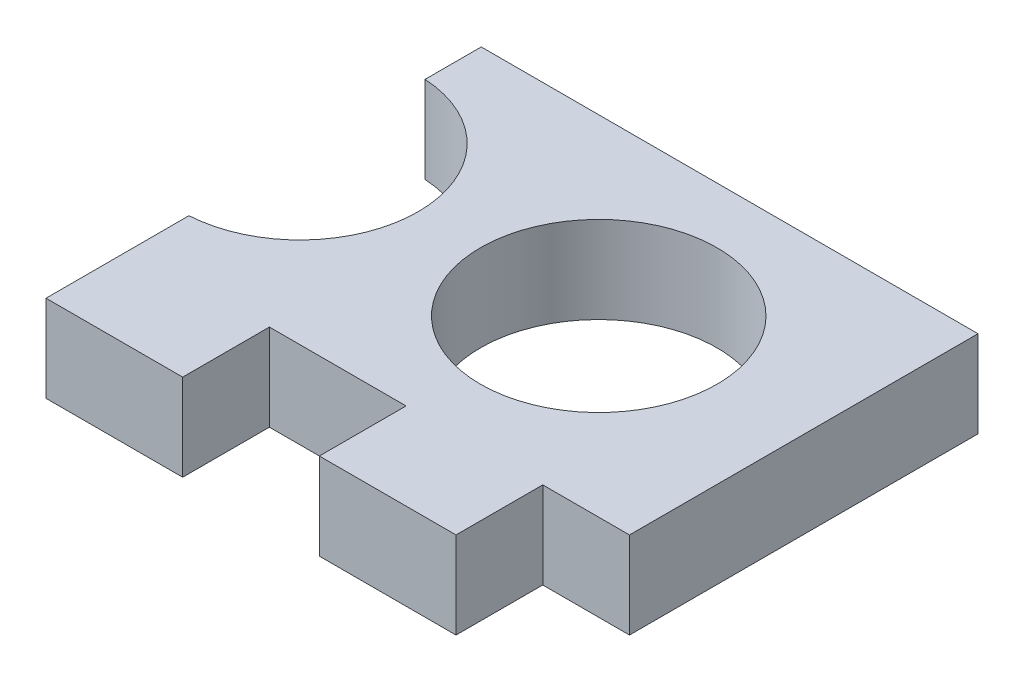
ISO-10303-21;
HEADER;
FILE_DESCRIPTION(('STEP AP214'),'2;1');
FILE_NAME('part.step','',(''),(''),'','','');
FILE_SCHEMA(('AUTOMOTIVE_DESIGN { 1 0 10303 214 1 1 1 1 }'));
ENDSEC;
DATA;
#1=APPLICATION_CONTEXT('core data for automotive mechanical design processes');
#2=APPLICATION_PROTOCOL_DEFINITION('international standard','automotive_design',2000,#1);
#3=PRODUCT_CONTEXT('',#1,'mechanical');
#4=PRODUCT('Part','Part','',(#3));
#5=PRODUCT_RELATED_PRODUCT_CATEGORY('part','',(#4));
#6=PRODUCT_DEFINITION_FORMATION('','',#4);
#7=PRODUCT_DEFINITION_CONTEXT('part definition',#1,'design');
#8=PRODUCT_DEFINITION('design','',#6,#7);
#9=PRODUCT_DEFINITION_SHAPE('','',#8);
#10=(LENGTH_UNIT() NAMED_UNIT(*) SI_UNIT(.MILLI.,.METRE.));
#11=(NAMED_UNIT(*) PLANE_ANGLE_UNIT() SI_UNIT($,.RADIAN.));
#12=(NAMED_UNIT(*) SI_UNIT($,.STERADIAN.) SOLID_ANGLE_UNIT());
#13=UNCERTAINTY_MEASURE_WITH_UNIT(LENGTH_MEASURE(1.E-05),#10,'distance_accuracy_value','');
#14=(GEOMETRIC_REPRESENTATION_CONTEXT(3) GLOBAL_UNCERTAINTY_ASSIGNED_CONTEXT((#13)) GLOBAL_UNIT_ASSIGNED_CONTEXT((#10,
#11,#12)) REPRESENTATION_CONTEXT('',''));
#15=CARTESIAN_POINT('',(0.,0.,0.));
#16=DIRECTION('',(0.,0.,1.));
#17=DIRECTION('',(1.,0.,0.));
#18=AXIS2_PLACEMENT_3D('',#15,#16,#17);
#19=CARTESIAN_POINT('',(-10.0398078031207,5.5,-2.49490250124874));
#20=DIRECTION('',(0.,1.,0.));
#21=DIRECTION('',(0.,0.,1.));
#22=AXIS2_PLACEMENT_3D('',#19,#20,#21);
#23=PLANE('',#22);
#24=DIRECTION('',(0.,0.,1.));
#25=VECTOR('',#24,1.);
#26=CARTESIAN_POINT('',(-9.5898078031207,5.5,8.55509749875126));
#27=LINE('',#26,#25);
#28=CARTESIAN_POINT('',(-9.5898078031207,5.5,4.99158532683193));
#29=VERTEX_POINT('',#28);
#30=CARTESIAN_POINT('',(-9.5898078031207,5.5,14.0550974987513));
#31=VERTEX_POINT('',#30);
#32=EDGE_CURVE('E108',#29,#31,#27,.T.);
#33=ORIENTED_EDGE('',*,*,#32,.T.);
#34=DIRECTION('',(1.,0.,0.));
#35=VECTOR('',#34,1.);
#36=CARTESIAN_POINT('',(-9.5898078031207,5.5,14.0550974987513));
#37=LINE('',#36,#35);
#38=CARTESIAN_POINT('',(-0.923140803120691,5.5,14.0550974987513));
#39=VERTEX_POINT('',#38);
#40=EDGE_CURVE('E249',#31,#39,#37,.T.);
#41=ORIENTED_EDGE('',*,*,#40,.T.);
#42=DIRECTION('',(0.,0.,-1.));
#43=VECTOR('',#42,1.);
#44=CARTESIAN_POINT('',(-0.923140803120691,5.5,14.0550974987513));
#45=LINE('',#44,#43);
#46=CARTESIAN_POINT('',(-0.923140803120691,5.5,8.55509749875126));
#47=VERTEX_POINT('',#46);
#48=EDGE_CURVE('E208',#39,#47,#45,.T.);
#49=ORIENTED_EDGE('',*,*,#48,.T.);
#50=DIRECTION('',(1.,0.,0.));
#51=VECTOR('',#50,1.);
#52=CARTESIAN_POINT('',(-0.923140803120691,5.5,8.55509749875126));
#53=LINE('',#52,#51);
#54=CARTESIAN_POINT('',(7.7435251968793,5.5,8.55509749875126));
#55=VERTEX_POINT('',#54);
#56=EDGE_CURVE('E227',#47,#55,#53,.T.);
#57=ORIENTED_EDGE('',*,*,#56,.T.);
#58=DIRECTION('',(0.,0.,1.));
#59=VECTOR('',#58,1.);
#60=CARTESIAN_POINT('',(7.7435251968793,5.5,8.55509749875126));
#61=LINE('',#60,#59);
#62=CARTESIAN_POINT('',(7.7435251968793,5.5,14.0550974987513));
#63=VERTEX_POINT('',#62);
#64=EDGE_CURVE('E224',#55,#63,#61,.T.);
#65=ORIENTED_EDGE('',*,*,#64,.T.);
#66=DIRECTION('',(1.,0.,0.));
#67=VECTOR('',#66,1.);
#68=CARTESIAN_POINT('',(7.7435251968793,5.5,14.0550974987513));
#69=LINE('',#68,#67);
#70=CARTESIAN_POINT('',(16.4101921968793,5.5,14.0550974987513));
#71=VERTEX_POINT('',#70);
#72=EDGE_CURVE('E226',#63,#71,#69,.T.);
#73=ORIENTED_EDGE('',*,*,#72,.T.);
#74=DIRECTION('',(0.,0.,-1.));
#75=VECTOR('',#74,1.);
#76=CARTESIAN_POINT('',(16.4101921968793,5.5,14.0550974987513));
#77=LINE('',#76,#75);
#78=CARTESIAN_POINT('',(16.4101921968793,5.5,8.55509749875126));
#79=VERTEX_POINT('',#78);
#80=EDGE_CURVE('E229',#71,#79,#77,.T.);
#81=ORIENTED_EDGE('',*,*,#80,.T.);
#82=DIRECTION('',(1.,0.,0.));
#83=VECTOR('',#82,1.);
#84=CARTESIAN_POINT('',(16.4101921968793,5.5,8.55509749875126));
#85=LINE('',#84,#83);
#86=CARTESIAN_POINT('',(21.9101921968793,5.5,8.55509749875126));
#87=VERTEX_POINT('',#86);
#88=EDGE_CURVE('E235',#79,#87,#85,.T.);
#89=ORIENTED_EDGE('',*,*,#88,.T.);
#90=DIRECTION('',(0.,0.,-1.));
#91=VECTOR('',#90,1.);
#92=CARTESIAN_POINT('',(21.9101921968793,5.5,8.55509749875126));
#93=LINE('',#92,#91);
#94=CARTESIAN_POINT('',(21.9101921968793,5.5,-13.5449025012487));
#95=VERTEX_POINT('',#94);
#96=EDGE_CURVE('E140',#87,#95,#93,.T.);
#97=ORIENTED_EDGE('',*,*,#96,.T.);
#98=DIRECTION('',(-1.,0.,0.));
#99=VECTOR('',#98,1.);
#100=CARTESIAN_POINT('',(21.9101921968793,5.5,-13.5449025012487));
#101=LINE('',#100,#99);
#102=CARTESIAN_POINT('',(-9.5898078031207,5.5,-13.5449025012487));
#103=VERTEX_POINT('',#102);
#104=EDGE_CURVE('E134',#95,#103,#101,.T.);
#105=ORIENTED_EDGE('',*,*,#104,.T.);
#106=DIRECTION('',(0.,0.,1.));
#107=VECTOR('',#106,1.);
#108=CARTESIAN_POINT('',(-9.5898078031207,5.5,-13.5449025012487));
#109=LINE('',#108,#107);
#110=CARTESIAN_POINT('',(-9.5898078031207,5.5,-9.98139032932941));
#111=VERTEX_POINT('',#110);
#112=EDGE_CURVE('E138',#103,#111,#109,.T.);
#113=ORIENTED_EDGE('',*,*,#112,.T.);
#114=CARTESIAN_POINT('',(-10.0398078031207,5.5,-2.49490250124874));
#115=DIRECTION('',(0.,-1.,0.));
#116=DIRECTION('',(0.,0.,1.));
#117=AXIS2_PLACEMENT_3D('',#114,#115,#116);
#118=CIRCLE('',#117,7.5);
#119=EDGE_CURVE('E54',#111,#29,#118,.T.);
#120=ORIENTED_EDGE('',*,*,#119,.T.);
#121=EDGE_LOOP('',(#33,#41,#49,#57,#65,#73,#81,#89,#97,#105,#113,#120));
#122=FACE_BOUND('',#121,.T.);
#123=CARTESIAN_POINT('',(8.91019219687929,5.5,-2.49490250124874));
#124=DIRECTION('',(0.,1.,0.));
#125=DIRECTION('',(0.,0.,1.));
#126=AXIS2_PLACEMENT_3D('',#123,#124,#125);
#127=CIRCLE('',#126,7.5);
#128=CARTESIAN_POINT('',(8.91019219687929,5.5,5.00509749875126));
#129=VERTEX_POINT('',#128);
#130=EDGE_CURVE('E160',#129,#129,#127,.T.);
#131=ORIENTED_EDGE('',*,*,#130,.F.);
#132=EDGE_LOOP('',(#131));
#133=FACE_BOUND('',#132,.T.);
#134=ADVANCED_FACE('F37',(#122,#133),#23,.T.);
#135=CARTESIAN_POINT('',(-10.0398078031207,0.,-2.49490250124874));
#136=DIRECTION('',(0.,1.,0.));
#137=DIRECTION('',(0.,0.,1.));
#138=AXIS2_PLACEMENT_3D('',#135,#136,#137);
#139=PLANE('',#138);
#140=DIRECTION('',(0.,0.,1.));
#141=VECTOR('',#140,1.);
#142=CARTESIAN_POINT('',(-9.5898078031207,0.,8.55509749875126));
#143=LINE('',#142,#141);
#144=CARTESIAN_POINT('',(-9.5898078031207,0.,4.99158532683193));
#145=VERTEX_POINT('',#144);
#146=CARTESIAN_POINT('',(-9.5898078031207,0.,14.0550974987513));
#147=VERTEX_POINT('',#146);
#148=EDGE_CURVE('E102',#145,#147,#143,.T.);
#149=ORIENTED_EDGE('',*,*,#148,.F.);
#150=CARTESIAN_POINT('',(-10.0398078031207,0.,-2.49490250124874));
#151=DIRECTION('',(0.,-1.,0.));
#152=DIRECTION('',(0.,0.,1.));
#153=AXIS2_PLACEMENT_3D('',#150,#151,#152);
#154=CIRCLE('',#153,7.5);
#155=CARTESIAN_POINT('',(-9.5898078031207,0.,-9.98139032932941));
#156=VERTEX_POINT('',#155);
#157=EDGE_CURVE('E178',#156,#145,#154,.T.);
#158=ORIENTED_EDGE('',*,*,#157,.F.);
#159=DIRECTION('',(0.,0.,1.));
#160=VECTOR('',#159,1.);
#161=CARTESIAN_POINT('',(-9.5898078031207,0.,-13.5449025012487));
#162=LINE('',#161,#160);
#163=CARTESIAN_POINT('',(-9.5898078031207,0.,-13.5449025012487));
#164=VERTEX_POINT('',#163);
#165=EDGE_CURVE('E95',#164,#156,#162,.T.);
#166=ORIENTED_EDGE('',*,*,#165,.F.);
#167=DIRECTION('',(-1.,0.,0.));
#168=VECTOR('',#167,1.);
#169=CARTESIAN_POINT('',(21.9101921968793,0.,-13.5449025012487));
#170=LINE('',#169,#168);
#171=CARTESIAN_POINT('',(21.9101921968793,0.,-13.5449025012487));
#172=VERTEX_POINT('',#171);
#173=EDGE_CURVE('E148',#172,#164,#170,.T.);
#174=ORIENTED_EDGE('',*,*,#173,.F.);
#175=DIRECTION('',(0.,0.,-1.));
#176=VECTOR('',#175,1.);
#177=CARTESIAN_POINT('',(21.9101921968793,0.,8.55509749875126));
#178=LINE('',#177,#176);
#179=CARTESIAN_POINT('',(21.9101921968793,0.,8.55509749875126));
#180=VERTEX_POINT('',#179);
#181=EDGE_CURVE('E174',#180,#172,#178,.T.);
#182=ORIENTED_EDGE('',*,*,#181,.F.);
#183=DIRECTION('',(1.,0.,0.));
#184=VECTOR('',#183,1.);
#185=CARTESIAN_POINT('',(16.4101921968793,0.,8.55509749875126));
#186=LINE('',#185,#184);
#187=CARTESIAN_POINT('',(16.4101921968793,0.,8.55509749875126));
#188=VERTEX_POINT('',#187);
#189=EDGE_CURVE('E172',#188,#180,#186,.T.);
#190=ORIENTED_EDGE('',*,*,#189,.F.);
#191=DIRECTION('',(0.,0.,-1.));
#192=VECTOR('',#191,1.);
#193=CARTESIAN_POINT('',(16.4101921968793,0.,14.0550974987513));
#194=LINE('',#193,#192);
#195=CARTESIAN_POINT('',(16.4101921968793,0.,14.0550974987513));
#196=VERTEX_POINT('',#195);
#197=EDGE_CURVE('E170',#196,#188,#194,.T.);
#198=ORIENTED_EDGE('',*,*,#197,.F.);
#199=DIRECTION('',(1.,0.,0.));
#200=VECTOR('',#199,1.);
#201=CARTESIAN_POINT('',(7.7435251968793,0.,14.0550974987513));
#202=LINE('',#201,#200);
#203=CARTESIAN_POINT('',(7.7435251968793,0.,14.0550974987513));
#204=VERTEX_POINT('',#203);
#205=EDGE_CURVE('E168',#204,#196,#202,.T.);
#206=ORIENTED_EDGE('',*,*,#205,.F.);
#207=DIRECTION('',(0.,0.,1.));
#208=VECTOR('',#207,1.);
#209=CARTESIAN_POINT('',(7.7435251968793,0.,8.55509749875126));
#210=LINE('',#209,#208);
#211=CARTESIAN_POINT('',(7.7435251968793,0.,8.55509749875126));
#212=VERTEX_POINT('',#211);
#213=EDGE_CURVE('E166',#212,#204,#210,.T.);
#214=ORIENTED_EDGE('',*,*,#213,.F.);
#215=DIRECTION('',(1.,0.,0.));
#216=VECTOR('',#215,1.);
#217=CARTESIAN_POINT('',(-0.923140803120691,0.,8.55509749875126));
#218=LINE('',#217,#216);
#219=CARTESIAN_POINT('',(-0.923140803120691,0.,8.55509749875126));
#220=VERTEX_POINT('',#219);
#221=EDGE_CURVE('E164',#220,#212,#218,.T.);
#222=ORIENTED_EDGE('',*,*,#221,.F.);
#223=DIRECTION('',(0.,0.,-1.));
#224=VECTOR('',#223,1.);
#225=CARTESIAN_POINT('',(-0.923140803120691,0.,14.0550974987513));
#226=LINE('',#225,#224);
#227=CARTESIAN_POINT('',(-0.923140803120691,0.,14.0550974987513));
#228=VERTEX_POINT('',#227);
#229=EDGE_CURVE('E162',#228,#220,#226,.T.);
#230=ORIENTED_EDGE('',*,*,#229,.F.);
#231=DIRECTION('',(1.,0.,0.));
#232=VECTOR('',#231,1.);
#233=CARTESIAN_POINT('',(-9.5898078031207,0.,14.0550974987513));
#234=LINE('',#233,#232);
#235=EDGE_CURVE('E159',#147,#228,#234,.T.);
#236=ORIENTED_EDGE('',*,*,#235,.F.);
#237=EDGE_LOOP('',(#149,#158,#166,#174,#182,#190,#198,#206,#214,#222,#230,#236));
#238=FACE_BOUND('',#237,.T.);
#239=CARTESIAN_POINT('',(8.91019219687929,0.,-2.49490250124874));
#240=DIRECTION('',(0.,1.,0.));
#241=DIRECTION('',(0.,0.,1.));
#242=AXIS2_PLACEMENT_3D('',#239,#240,#241);
#243=CIRCLE('',#242,7.5);
#244=CARTESIAN_POINT('',(8.91019219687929,0.,5.00509749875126));
#245=VERTEX_POINT('',#244);
#246=EDGE_CURVE('E253',#245,#245,#243,.T.);
#247=ORIENTED_EDGE('',*,*,#246,.T.);
#248=EDGE_LOOP('',(#247));
#249=FACE_BOUND('',#248,.T.);
#250=ADVANCED_FACE('F212',(#238,#249),#139,.F.);
#251=CARTESIAN_POINT('',(-9.5898078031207,5.5,8.55509749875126));
#252=DIRECTION('',(1.,0.,0.));
#253=DIRECTION('',(0.,0.,-1.));
#254=AXIS2_PLACEMENT_3D('',#251,#252,#253);
#255=PLANE('',#254);
#256=ORIENTED_EDGE('',*,*,#148,.T.);
#257=DIRECTION('',(0.,-1.,0.));
#258=VECTOR('',#257,1.);
#259=CARTESIAN_POINT('',(-9.5898078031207,5.5,14.0550974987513));
#260=LINE('',#259,#258);
#261=EDGE_CURVE('E11',#31,#147,#260,.T.);
#262=ORIENTED_EDGE('',*,*,#261,.F.);
#263=ORIENTED_EDGE('',*,*,#32,.F.);
#264=DIRECTION('',(0.,-1.,0.));
#265=VECTOR('',#264,1.);
#266=CARTESIAN_POINT('',(-9.5898078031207,5.5,4.99158532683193));
#267=LINE('',#266,#265);
#268=EDGE_CURVE('E154',#29,#145,#267,.T.);
#269=ORIENTED_EDGE('',*,*,#268,.T.);
#270=EDGE_LOOP('',(#256,#262,#263,#269));
#271=FACE_BOUND('',#270,.T.);
#272=ADVANCED_FACE('F39',(#271),#255,.F.);
#273=CARTESIAN_POINT('',(-9.5898078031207,5.5,14.0550974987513));
#274=DIRECTION('',(0.,0.,-1.));
#275=DIRECTION('',(-1.,0.,0.));
#276=AXIS2_PLACEMENT_3D('',#273,#274,#275);
#277=PLANE('',#276);
#278=ORIENTED_EDGE('',*,*,#235,.T.);
#279=DIRECTION('',(0.,-1.,0.));
#280=VECTOR('',#279,1.);
#281=CARTESIAN_POINT('',(-0.923140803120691,5.5,14.0550974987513));
#282=LINE('',#281,#280);
#283=EDGE_CURVE('E46',#39,#228,#282,.T.);
#284=ORIENTED_EDGE('',*,*,#283,.F.);
#285=ORIENTED_EDGE('',*,*,#40,.F.);
#286=ORIENTED_EDGE('',*,*,#261,.T.);
#287=EDGE_LOOP('',(#278,#284,#285,#286));
#288=FACE_BOUND('',#287,.T.);
#289=ADVANCED_FACE('F255',(#288),#277,.F.);
#290=CARTESIAN_POINT('',(-0.923140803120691,5.5,14.0550974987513));
#291=DIRECTION('',(-1.,0.,0.));
#292=DIRECTION('',(0.,0.,1.));
#293=AXIS2_PLACEMENT_3D('',#290,#291,#292);
#294=PLANE('',#293);
#295=ORIENTED_EDGE('',*,*,#229,.T.);
#296=DIRECTION('',(0.,-1.,0.));
#297=VECTOR('',#296,1.);
#298=CARTESIAN_POINT('',(-0.923140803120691,5.5,8.55509749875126));
#299=LINE('',#298,#297);
#300=EDGE_CURVE('E199',#47,#220,#299,.T.);
#301=ORIENTED_EDGE('',*,*,#300,.F.);
#302=ORIENTED_EDGE('',*,*,#48,.F.);
#303=ORIENTED_EDGE('',*,*,#283,.T.);
#304=EDGE_LOOP('',(#295,#301,#302,#303));
#305=FACE_BOUND('',#304,.T.);
#306=ADVANCED_FACE('F206',(#305),#294,.F.);
#307=CARTESIAN_POINT('',(-0.923140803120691,5.5,8.55509749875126));
#308=DIRECTION('',(0.,0.,-1.));
#309=DIRECTION('',(-1.,0.,0.));
#310=AXIS2_PLACEMENT_3D('',#307,#308,#309);
#311=PLANE('',#310);
#312=ORIENTED_EDGE('',*,*,#221,.T.);
#313=DIRECTION('',(0.,-1.,0.));
#314=VECTOR('',#313,1.);
#315=CARTESIAN_POINT('',(7.7435251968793,5.5,8.55509749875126));
#316=LINE('',#315,#314);
#317=EDGE_CURVE('E196',#55,#212,#316,.T.);
#318=ORIENTED_EDGE('',*,*,#317,.F.);
#319=ORIENTED_EDGE('',*,*,#56,.F.);
#320=ORIENTED_EDGE('',*,*,#300,.T.);
#321=EDGE_LOOP('',(#312,#318,#319,#320));
#322=FACE_BOUND('',#321,.T.);
#323=ADVANCED_FACE('F218',(#322),#311,.F.);
#324=CARTESIAN_POINT('',(7.7435251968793,5.5,8.55509749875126));
#325=DIRECTION('',(1.,0.,0.));
#326=DIRECTION('',(0.,0.,-1.));
#327=AXIS2_PLACEMENT_3D('',#324,#325,#326);
#328=PLANE('',#327);
#329=ORIENTED_EDGE('',*,*,#213,.T.);
#330=DIRECTION('',(0.,-1.,0.));
#331=VECTOR('',#330,1.);
#332=CARTESIAN_POINT('',(7.7435251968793,5.5,14.0550974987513));
#333=LINE('',#332,#331);
#334=EDGE_CURVE('E193',#63,#204,#333,.T.);
#335=ORIENTED_EDGE('',*,*,#334,.F.);
#336=ORIENTED_EDGE('',*,*,#64,.F.);
#337=ORIENTED_EDGE('',*,*,#317,.T.);
#338=EDGE_LOOP('',(#329,#335,#336,#337));
#339=FACE_BOUND('',#338,.T.);
#340=ADVANCED_FACE('F222',(#339),#328,.F.);
#341=CARTESIAN_POINT('',(7.7435251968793,5.5,14.0550974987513));
#342=DIRECTION('',(0.,0.,-1.));
#343=DIRECTION('',(-1.,0.,0.));
#344=AXIS2_PLACEMENT_3D('',#341,#342,#343);
#345=PLANE('',#344);
#346=ORIENTED_EDGE('',*,*,#205,.T.);
#347=DIRECTION('',(0.,-1.,0.));
#348=VECTOR('',#347,1.);
#349=CARTESIAN_POINT('',(16.4101921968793,5.5,14.0550974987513));
#350=LINE('',#349,#348);
#351=EDGE_CURVE('E190',#71,#196,#350,.T.);
#352=ORIENTED_EDGE('',*,*,#351,.F.);
#353=ORIENTED_EDGE('',*,*,#72,.F.);
#354=ORIENTED_EDGE('',*,*,#334,.T.);
#355=EDGE_LOOP('',(#346,#352,#353,#354));
#356=FACE_BOUND('',#355,.T.);
#357=ADVANCED_FACE('F284',(#356),#345,.F.);
#358=CARTESIAN_POINT('',(16.4101921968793,5.5,14.0550974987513));
#359=DIRECTION('',(-1.,0.,0.));
#360=DIRECTION('',(0.,0.,1.));
#361=AXIS2_PLACEMENT_3D('',#358,#359,#360);
#362=PLANE('',#361);
#363=ORIENTED_EDGE('',*,*,#197,.T.);
#364=DIRECTION('',(0.,-1.,0.));
#365=VECTOR('',#364,1.);
#366=CARTESIAN_POINT('',(16.4101921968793,5.5,8.55509749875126));
#367=LINE('',#366,#365);
#368=EDGE_CURVE('E187',#79,#188,#367,.T.);
#369=ORIENTED_EDGE('',*,*,#368,.F.);
#370=ORIENTED_EDGE('',*,*,#80,.F.);
#371=ORIENTED_EDGE('',*,*,#351,.T.);
#372=EDGE_LOOP('',(#363,#369,#370,#371));
#373=FACE_BOUND('',#372,.T.);
#374=ADVANCED_FACE('F281',(#373),#362,.F.);
#375=CARTESIAN_POINT('',(16.4101921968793,5.5,8.55509749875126));
#376=DIRECTION('',(0.,0.,-1.));
#377=DIRECTION('',(-1.,0.,0.));
#378=AXIS2_PLACEMENT_3D('',#375,#376,#377);
#379=PLANE('',#378);
#380=ORIENTED_EDGE('',*,*,#189,.T.);
#381=DIRECTION('',(0.,-1.,0.));
#382=VECTOR('',#381,1.);
#383=CARTESIAN_POINT('',(21.9101921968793,5.5,8.55509749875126));
#384=LINE('',#383,#382);
#385=EDGE_CURVE('E184',#87,#180,#384,.T.);
#386=ORIENTED_EDGE('',*,*,#385,.F.);
#387=ORIENTED_EDGE('',*,*,#88,.F.);
#388=ORIENTED_EDGE('',*,*,#368,.T.);
#389=EDGE_LOOP('',(#380,#386,#387,#388));
#390=FACE_BOUND('',#389,.T.);
#391=ADVANCED_FACE('F241',(#390),#379,.F.);
#392=CARTESIAN_POINT('',(21.9101921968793,5.5,8.55509749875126));
#393=DIRECTION('',(-1.,0.,0.));
#394=DIRECTION('',(0.,0.,1.));
#395=AXIS2_PLACEMENT_3D('',#392,#393,#394);
#396=PLANE('',#395);
#397=ORIENTED_EDGE('',*,*,#181,.T.);
#398=DIRECTION('',(0.,-1.,0.));
#399=VECTOR('',#398,1.);
#400=CARTESIAN_POINT('',(21.9101921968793,5.5,-13.5449025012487));
#401=LINE('',#400,#399);
#402=EDGE_CURVE('E149',#95,#172,#401,.T.);
#403=ORIENTED_EDGE('',*,*,#402,.F.);
#404=ORIENTED_EDGE('',*,*,#96,.F.);
#405=ORIENTED_EDGE('',*,*,#385,.T.);
#406=EDGE_LOOP('',(#397,#403,#404,#405));
#407=FACE_BOUND('',#406,.T.);
#408=ADVANCED_FACE('F245',(#407),#396,.F.);
#409=CARTESIAN_POINT('',(21.9101921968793,5.5,-13.5449025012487));
#410=DIRECTION('',(0.,0.,1.));
#411=DIRECTION('',(1.,0.,0.));
#412=AXIS2_PLACEMENT_3D('',#409,#410,#411);
#413=PLANE('',#412);
#414=ORIENTED_EDGE('',*,*,#173,.T.);
#415=DIRECTION('',(0.,-1.,0.));
#416=VECTOR('',#415,1.);
#417=CARTESIAN_POINT('',(-9.5898078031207,5.5,-13.5449025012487));
#418=LINE('',#417,#416);
#419=EDGE_CURVE('E145',#103,#164,#418,.T.);
#420=ORIENTED_EDGE('',*,*,#419,.F.);
#421=ORIENTED_EDGE('',*,*,#104,.F.);
#422=ORIENTED_EDGE('',*,*,#402,.T.);
#423=EDGE_LOOP('',(#414,#420,#421,#422));
#424=FACE_BOUND('',#423,.T.);
#425=ADVANCED_FACE('F146',(#424),#413,.F.);
#426=CARTESIAN_POINT('',(-9.5898078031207,5.5,-13.5449025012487));
#427=DIRECTION('',(1.,0.,0.));
#428=DIRECTION('',(0.,0.,-1.));
#429=AXIS2_PLACEMENT_3D('',#426,#427,#428);
#430=PLANE('',#429);
#431=ORIENTED_EDGE('',*,*,#165,.T.);
#432=DIRECTION('',(0.,-1.,0.));
#433=VECTOR('',#432,1.);
#434=CARTESIAN_POINT('',(-9.5898078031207,5.5,-9.98139032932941));
#435=LINE('',#434,#433);
#436=EDGE_CURVE('E150',#111,#156,#435,.T.);
#437=ORIENTED_EDGE('',*,*,#436,.F.);
#438=ORIENTED_EDGE('',*,*,#112,.F.);
#439=ORIENTED_EDGE('',*,*,#419,.T.);
#440=EDGE_LOOP('',(#431,#437,#438,#439));
#441=FACE_BOUND('',#440,.T.);
#442=ADVANCED_FACE('F152',(#441),#430,.F.);
#443=CARTESIAN_POINT('',(-10.0398078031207,5.5,-2.49490250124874));
#444=DIRECTION('',(0.,-1.,0.));
#445=DIRECTION('',(0.,0.,-1.));
#446=AXIS2_PLACEMENT_3D('',#443,#444,#445);
#447=CYLINDRICAL_SURFACE('',#446,7.5);
#448=ORIENTED_EDGE('',*,*,#157,.T.);
#449=ORIENTED_EDGE('',*,*,#268,.F.);
#450=ORIENTED_EDGE('',*,*,#119,.F.);
#451=ORIENTED_EDGE('',*,*,#436,.T.);
#452=EDGE_LOOP('',(#448,#449,#450,#451));
#453=FACE_BOUND('',#452,.T.);
#454=ADVANCED_FACE('F247',(#453),#447,.F.);
#455=CARTESIAN_POINT('',(8.91019219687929,5.5,-2.49490250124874));
#456=DIRECTION('',(0.,-1.,0.));
#457=DIRECTION('',(0.,0.,-1.));
#458=AXIS2_PLACEMENT_3D('',#455,#456,#457);
#459=CYLINDRICAL_SURFACE('',#458,7.5);
#460=ORIENTED_EDGE('',*,*,#130,.T.);
#461=EDGE_LOOP('',(#460));
#462=FACE_BOUND('',#461,.T.);
#463=ORIENTED_EDGE('',*,*,#246,.F.);
#464=EDGE_LOOP('',(#463));
#465=FACE_BOUND('',#464,.T.);
#466=ADVANCED_FACE('F269',(#462,#465),#459,.F.);
#467=CLOSED_SHELL('',(#134,#250,#272,#289,#306,#323,#340,#357,#374,#391,#408,#425,#442,#454,#466));
#468=MANIFOLD_SOLID_BREP('B2',#467);
#469=ADVANCED_BREP_SHAPE_REPRESENTATION('',(#18,#468),#14);
#470=SHAPE_DEFINITION_REPRESENTATION(#9,#469);
ENDSEC;
END-ISO-10303-21;
